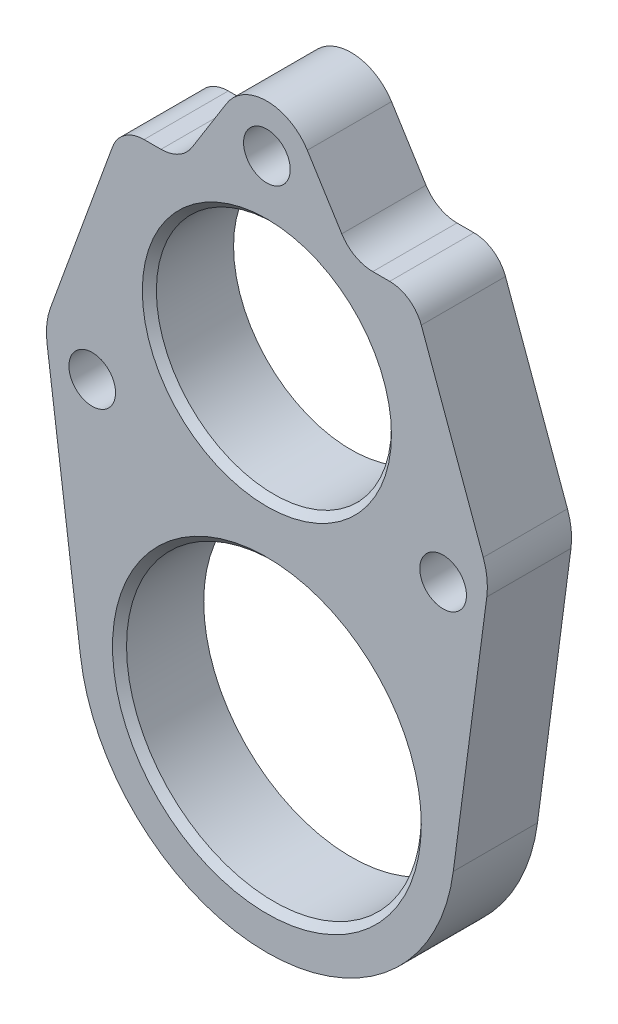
from build123d import *

# Parameters (mm, degrees)
EXTRUSION1_DEPTH        = 12
ESQUISSE2_R             = 3.3235
ENL_V_MAT_EXTRU_1_DEPTH = 81.184724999
ESQUISSE3_R             = 16.75
ESQUISSE3_R_2           = 21
ENL_V_MAT_EXTRU_2_DEPTH = 81.184724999
CHANFREIN1_SIZE         = 1


with BuildPart() as part:
    # Esquisse1 → Extrusion1 (new body)
    with BuildSketch(Plane.XY):
        with BuildLine():
            Line((-22.001634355, 15.638460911), (-30.828143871, -8.612174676))
            ThreePointArc((-30.828143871, -8.612174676), (-31.360393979, -10.894870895), (-31.334826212, -13.238658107))
            Line((-31.334826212, -13.238658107), (-26.561342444, -49.496867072))
            ThreePointArc((-26.561342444, -49.496867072), (0, -72.790539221), (26.561342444, -49.496867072))
            Line((26.561342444, -49.496867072), (31.334826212, -13.238658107))
            ThreePointArc((31.334826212, -13.238658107), (31.360393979, -10.894870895), (30.828143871, -8.612174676))
            Line((30.828143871, -8.612174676), (22.001634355, 15.638460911))
            ThreePointArc((22.001634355, 15.638460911), (20.247740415, 17.924179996), (17.5, 18.790539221))
            Line((17.5, 18.790539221), (15.087444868, 18.790539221))
            ThreePointArc((15.087444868, 18.790539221), (12.561848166, 19.443702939), (10.669571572, 21.239406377))
            Line((10.669571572, 21.239406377), (5.758703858, 29.098437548))
            ThreePointArc((5.758703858, 29.098437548), (0, 32.290539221), (-5.758703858, 29.098437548))
            Line((-5.758703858, 29.098437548), (-10.669571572, 21.239406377))
            ThreePointArc((-10.669571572, 21.239406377), (-12.561848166, 19.443702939), (-15.087444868, 18.790539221))
            Line((-15.087444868, 18.790539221), (-17.5, 18.790539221))
            ThreePointArc((-17.5, 18.790539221), (-20.247740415, 17.924179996), (-22.001634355, 15.638460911))
        make_face()
    extrude(amount=EXTRUSION1_DEPTH)

    # Esquisse2 → Enl_v. mat.-Extru.1 (cut, through all)
    with BuildSketch(Plane(origin=(0, 0, 0), x_dir=(-1, 0, 0), z_dir=(0, 0, -1))):
        with Locations((0, 25.5)):
            Circle(ESQUISSE2_R)
        with Locations((-25.11159304, -14.5)):
            Circle(ESQUISSE2_R)
        with Locations((24.88840696, -14.5)):
            Circle(ESQUISSE2_R)
    extrude(amount=-ENL_V_MAT_EXTRU_1_DEPTH, mode=Mode.SUBTRACT)

    # Esquisse3 → Enl_v. mat.-Extru.2 (cut, through all)
    with BuildSketch(Plane(origin=(0, 0, 0), x_dir=(-1, 0, 0), z_dir=(0, 0, -1))):
        Circle(ESQUISSE3_R)
        with Locations((0, -46)):
            Circle(ESQUISSE3_R_2)
    extrude(amount=-ENL_V_MAT_EXTRU_2_DEPTH, mode=Mode.SUBTRACT)

    # Chanfrein1
    chanfrein1_edges = [part.edges().sort_by_distance(p)[0] for p in [
        (16.75, 0, 12),
        (21, -46, 12),
    ]]
    chamfer(chanfrein1_edges, length=CHANFREIN1_SIZE)


solid = part.part
